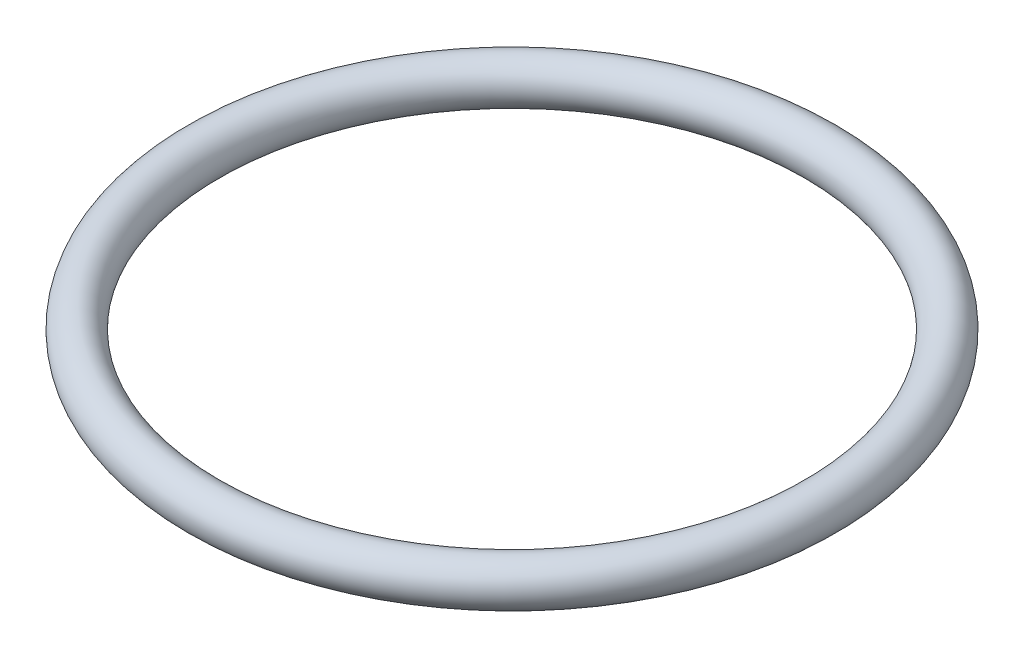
from build123d import *

# Parameters (mm, degrees)
ESQUISSE1_R = 2.85


with BuildPart() as part:
    # Esquisse1 → Base-R_volution (revolve)
    with BuildSketch(Plane.XY, mode=Mode.PRIVATE) as base_r_volution_sk:
        with Locations((40.35, 0)):
            Circle(ESQUISSE1_R)
    revolve(base_r_volution_sk.sketch.rotate(Axis((0, 2.85, 0), (0, -1, 0)), 90), axis=Axis((0, 2.85, 0), (0, -1, 0)))


solid = part.part
